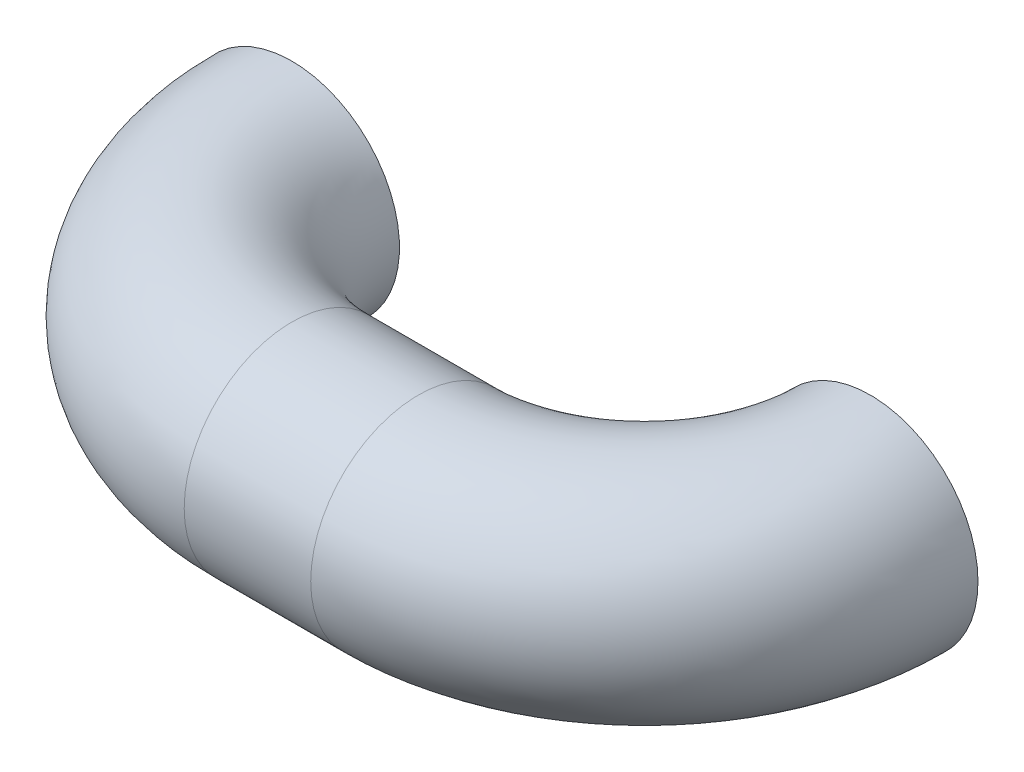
from build123d import *

# Parameters (mm, degrees)
CROQUIS1_R              = 4.7625
CROQUIS1_R_2            = 3.8625
REVOLUCI_N5_ANGLE       = 90
CROQUIS7_R              = 4.7625
CROQUIS7_R_2            = 3.8625
SALIENTE_EXTRUIR3_DEPTH = 5.5976
CROQUIS8_R              = 4.7625
CROQUIS8_R_2            = 3.8625
REVOLUCI_N6_ANGLE       = 90


with BuildPart() as part:
    # Croquis1 → Revoluci_n5 (revolve)
    with BuildSketch(Plane.XY):
        Circle(CROQUIS1_R)
        Circle(CROQUIS1_R_2, mode=Mode.SUBTRACT)
    revolve(axis=Axis((-10, 0, 0), (0, -1, 0)), revolution_arc=REVOLUCI_N5_ANGLE)

    # Croquis7 → Saliente-Extruir3 (add)
    with BuildSketch(Plane.ZY.offset(10)):
        with Locations((10, 0)):
            Circle(CROQUIS7_R)
        with Locations((10, 0)):
            Circle(CROQUIS7_R_2, mode=Mode.SUBTRACT)
    extrude(amount=SALIENTE_EXTRUIR3_DEPTH)

    # Croquis8 → Revoluci_n6 (revolve)
    with BuildSketch(Plane.ZY.offset(15.5976)):
        with Locations((10, 0)):
            Circle(CROQUIS8_R)
        with Locations((10, 0)):
            Circle(CROQUIS8_R_2, mode=Mode.SUBTRACT)
    revolve(axis=Axis((-15.5976, 7.03031966, 0), (0, -1, 0)), revolution_arc=REVOLUCI_N6_ANGLE)


solid = part.part
